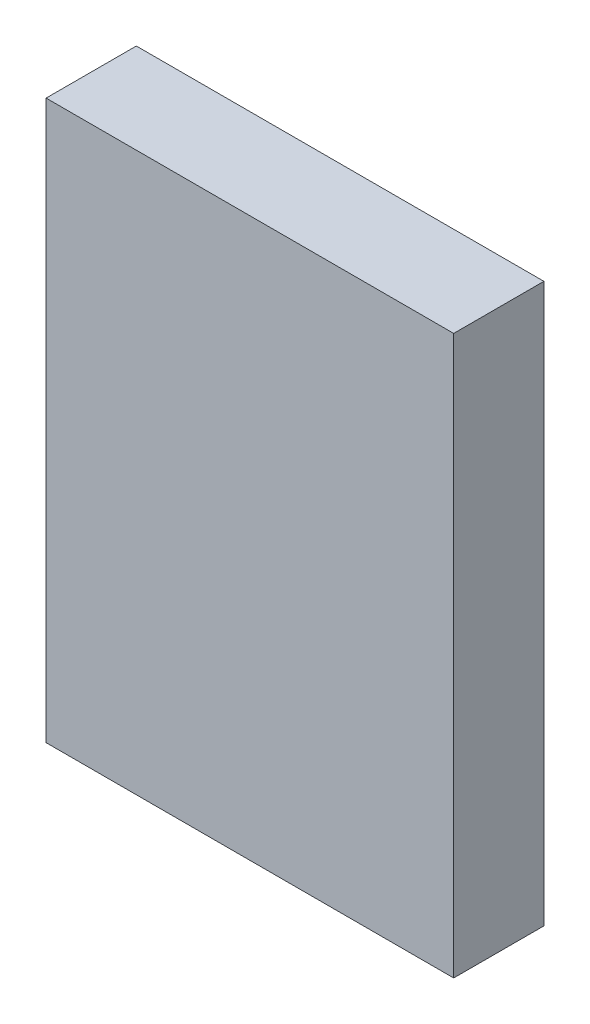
ISO-10303-21;
HEADER;
FILE_DESCRIPTION(('STEP AP214'),'2;1');
FILE_NAME('part.step','',(''),(''),'','','');
FILE_SCHEMA(('AUTOMOTIVE_DESIGN { 1 0 10303 214 1 1 1 1 }'));
ENDSEC;
DATA;
#1=APPLICATION_CONTEXT('core data for automotive mechanical design processes');
#2=APPLICATION_PROTOCOL_DEFINITION('international standard','automotive_design',2000,#1);
#3=PRODUCT_CONTEXT('',#1,'mechanical');
#4=PRODUCT('Part','Part','',(#3));
#5=PRODUCT_RELATED_PRODUCT_CATEGORY('part','',(#4));
#6=PRODUCT_DEFINITION_FORMATION('','',#4);
#7=PRODUCT_DEFINITION_CONTEXT('part definition',#1,'design');
#8=PRODUCT_DEFINITION('design','',#6,#7);
#9=PRODUCT_DEFINITION_SHAPE('','',#8);
#10=(LENGTH_UNIT() NAMED_UNIT(*) SI_UNIT(.MILLI.,.METRE.));
#11=(NAMED_UNIT(*) PLANE_ANGLE_UNIT() SI_UNIT($,.RADIAN.));
#12=(NAMED_UNIT(*) SI_UNIT($,.STERADIAN.) SOLID_ANGLE_UNIT());
#13=UNCERTAINTY_MEASURE_WITH_UNIT(LENGTH_MEASURE(1.E-05),#10,'distance_accuracy_value','');
#14=(GEOMETRIC_REPRESENTATION_CONTEXT(3) GLOBAL_UNCERTAINTY_ASSIGNED_CONTEXT((#13)) GLOBAL_UNIT_ASSIGNED_CONTEXT((#10,
#11,#12)) REPRESENTATION_CONTEXT('',''));
#15=CARTESIAN_POINT('',(0.,0.,0.));
#16=DIRECTION('',(0.,0.,1.));
#17=DIRECTION('',(1.,0.,0.));
#18=AXIS2_PLACEMENT_3D('',#15,#16,#17);
#19=CARTESIAN_POINT('',(4.31500026,-5.90999834,1.91));
#20=DIRECTION('',(0.,0.,-1.));
#21=DIRECTION('',(-1.,0.,0.));
#22=AXIS2_PLACEMENT_3D('',#19,#20,#21);
#23=PLANE('',#22);
#24=DIRECTION('',(1.,0.,0.));
#25=VECTOR('',#24,1.);
#26=CARTESIAN_POINT('',(4.31500026,5.91000088,1.91));
#27=LINE('',#26,#25);
#28=CARTESIAN_POINT('',(4.31500026,5.91000088,1.91));
#29=VERTEX_POINT('',#28);
#30=CARTESIAN_POINT('',(-4.31500026,5.91000088,1.91));
#31=VERTEX_POINT('',#30);
#32=EDGE_CURVE('E55',#29,#31,#27,.F.);
#33=ORIENTED_EDGE('',*,*,#32,.T.);
#34=DIRECTION('',(0.,1.,0.));
#35=VECTOR('',#34,1.);
#36=CARTESIAN_POINT('',(-4.31500026,5.91000088,1.91));
#37=LINE('',#36,#35);
#38=CARTESIAN_POINT('',(-4.31500026,-5.90999834,1.91));
#39=VERTEX_POINT('',#38);
#40=EDGE_CURVE('E57',#31,#39,#37,.F.);
#41=ORIENTED_EDGE('',*,*,#40,.T.);
#42=DIRECTION('',(1.,0.,0.));
#43=VECTOR('',#42,1.);
#44=CARTESIAN_POINT('',(-4.31500026,-5.90999834,1.91));
#45=LINE('',#44,#43);
#46=CARTESIAN_POINT('',(4.31500026,-5.90999834,1.91));
#47=VERTEX_POINT('',#46);
#48=EDGE_CURVE('E20',#39,#47,#45,.T.);
#49=ORIENTED_EDGE('',*,*,#48,.T.);
#50=DIRECTION('',(0.,1.,0.));
#51=VECTOR('',#50,1.);
#52=CARTESIAN_POINT('',(4.31500026,-5.90999834,1.91));
#53=LINE('',#52,#51);
#54=EDGE_CURVE('E80',#47,#29,#53,.T.);
#55=ORIENTED_EDGE('',*,*,#54,.T.);
#56=EDGE_LOOP('',(#33,#41,#49,#55));
#57=FACE_BOUND('',#56,.T.);
#58=ADVANCED_FACE('F17',(#57),#23,.F.);
#59=CARTESIAN_POINT('',(-4.31500026,-5.90999834,0.));
#60=DIRECTION('',(0.,1.,0.));
#61=DIRECTION('',(0.,0.,1.));
#62=AXIS2_PLACEMENT_3D('',#59,#60,#61);
#63=PLANE('',#62);
#64=DIRECTION('',(0.,0.,1.));
#65=VECTOR('',#64,1.);
#66=CARTESIAN_POINT('',(4.31500026,-5.90999834,0.));
#67=LINE('',#66,#65);
#68=CARTESIAN_POINT('',(4.31500026,-5.90999834,0.));
#69=VERTEX_POINT('',#68);
#70=EDGE_CURVE('E68',#69,#47,#67,.T.);
#71=ORIENTED_EDGE('',*,*,#70,.T.);
#72=ORIENTED_EDGE('',*,*,#48,.F.);
#73=DIRECTION('',(0.,0.,-1.));
#74=VECTOR('',#73,1.);
#75=CARTESIAN_POINT('',(-4.31500026,-5.90999834,0.));
#76=LINE('',#75,#74);
#77=CARTESIAN_POINT('',(-4.31500026,-5.90999834,0.));
#78=VERTEX_POINT('',#77);
#79=EDGE_CURVE('E63',#39,#78,#76,.T.);
#80=ORIENTED_EDGE('',*,*,#79,.T.);
#81=DIRECTION('',(-1.,0.,0.));
#82=VECTOR('',#81,1.);
#83=CARTESIAN_POINT('',(4.31500026,-5.90999834,0.));
#84=LINE('',#83,#82);
#85=EDGE_CURVE('E83',#69,#78,#84,.T.);
#86=ORIENTED_EDGE('',*,*,#85,.F.);
#87=EDGE_LOOP('',(#71,#72,#80,#86));
#88=FACE_BOUND('',#87,.T.);
#89=ADVANCED_FACE('F65',(#88),#63,.F.);
#90=CARTESIAN_POINT('',(-4.31500026,5.91000088,0.));
#91=DIRECTION('',(1.,0.,0.));
#92=DIRECTION('',(0.,0.,-1.));
#93=AXIS2_PLACEMENT_3D('',#90,#91,#92);
#94=PLANE('',#93);
#95=ORIENTED_EDGE('',*,*,#79,.F.);
#96=ORIENTED_EDGE('',*,*,#40,.F.);
#97=DIRECTION('',(0.,0.,-1.));
#98=VECTOR('',#97,1.);
#99=CARTESIAN_POINT('',(-4.31500026,5.91000088,0.));
#100=LINE('',#99,#98);
#101=CARTESIAN_POINT('',(-4.31500026,5.91000088,0.));
#102=VERTEX_POINT('',#101);
#103=EDGE_CURVE('E75',#31,#102,#100,.T.);
#104=ORIENTED_EDGE('',*,*,#103,.T.);
#105=DIRECTION('',(0.,1.,0.));
#106=VECTOR('',#105,1.);
#107=CARTESIAN_POINT('',(-4.31500026,-5.90999834,0.));
#108=LINE('',#107,#106);
#109=EDGE_CURVE('E72',#78,#102,#108,.T.);
#110=ORIENTED_EDGE('',*,*,#109,.F.);
#111=EDGE_LOOP('',(#95,#96,#104,#110));
#112=FACE_BOUND('',#111,.T.);
#113=ADVANCED_FACE('F70',(#112),#94,.F.);
#114=CARTESIAN_POINT('',(4.31500026,5.91000088,0.));
#115=DIRECTION('',(0.,-1.,0.));
#116=DIRECTION('',(0.,0.,-1.));
#117=AXIS2_PLACEMENT_3D('',#114,#115,#116);
#118=PLANE('',#117);
#119=ORIENTED_EDGE('',*,*,#103,.F.);
#120=ORIENTED_EDGE('',*,*,#32,.F.);
#121=DIRECTION('',(0.,0.,1.));
#122=VECTOR('',#121,1.);
#123=CARTESIAN_POINT('',(4.31500026,5.91000088,0.));
#124=LINE('',#123,#122);
#125=CARTESIAN_POINT('',(4.31500026,5.91000088,0.));
#126=VERTEX_POINT('',#125);
#127=EDGE_CURVE('E35',#29,#126,#124,.F.);
#128=ORIENTED_EDGE('',*,*,#127,.T.);
#129=DIRECTION('',(-1.,0.,0.));
#130=VECTOR('',#129,1.);
#131=CARTESIAN_POINT('',(4.31500026,5.91000088,0.));
#132=LINE('',#131,#130);
#133=EDGE_CURVE('E26',#102,#126,#132,.F.);
#134=ORIENTED_EDGE('',*,*,#133,.F.);
#135=EDGE_LOOP('',(#119,#120,#128,#134));
#136=FACE_BOUND('',#135,.T.);
#137=ADVANCED_FACE('F89',(#136),#118,.F.);
#138=CARTESIAN_POINT('',(4.31500026,-5.90999834,0.));
#139=DIRECTION('',(-1.,0.,0.));
#140=DIRECTION('',(0.,0.,1.));
#141=AXIS2_PLACEMENT_3D('',#138,#139,#140);
#142=PLANE('',#141);
#143=ORIENTED_EDGE('',*,*,#127,.F.);
#144=ORIENTED_EDGE('',*,*,#54,.F.);
#145=ORIENTED_EDGE('',*,*,#70,.F.);
#146=DIRECTION('',(0.,1.,0.));
#147=VECTOR('',#146,1.);
#148=CARTESIAN_POINT('',(4.31500026,-5.90999834,0.));
#149=LINE('',#148,#147);
#150=EDGE_CURVE('E11',#126,#69,#149,.F.);
#151=ORIENTED_EDGE('',*,*,#150,.F.);
#152=EDGE_LOOP('',(#143,#144,#145,#151));
#153=FACE_BOUND('',#152,.T.);
#154=ADVANCED_FACE('F91',(#153),#142,.F.);
#155=CARTESIAN_POINT('',(4.31500026,-5.90999834,0.));
#156=DIRECTION('',(0.,0.,-1.));
#157=DIRECTION('',(-1.,0.,0.));
#158=AXIS2_PLACEMENT_3D('',#155,#156,#157);
#159=PLANE('',#158);
#160=ORIENTED_EDGE('',*,*,#133,.T.);
#161=ORIENTED_EDGE('',*,*,#150,.T.);
#162=ORIENTED_EDGE('',*,*,#85,.T.);
#163=ORIENTED_EDGE('',*,*,#109,.T.);
#164=EDGE_LOOP('',(#160,#161,#162,#163));
#165=FACE_BOUND('',#164,.T.);
#166=ADVANCED_FACE('F88',(#165),#159,.T.);
#167=CLOSED_SHELL('',(#58,#89,#113,#137,#154,#166));
#168=MANIFOLD_SOLID_BREP('B1',#167);
#169=ADVANCED_BREP_SHAPE_REPRESENTATION('',(#18,#168),#14);
#170=SHAPE_DEFINITION_REPRESENTATION(#9,#169);
ENDSEC;
END-ISO-10303-21;
